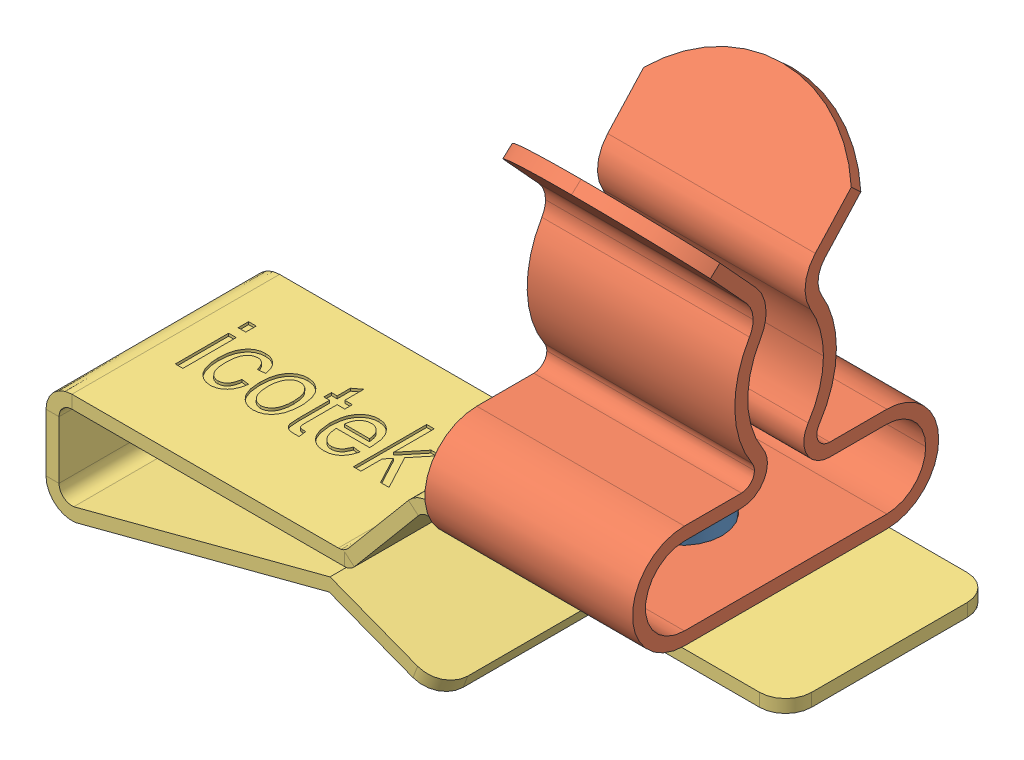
SolidWorks assembly 36786_2.SLDASM, configuration Default (file format 8000). Lengths in mm.
Overall size (28.5 21.09 11.8).
3 component instances, 3 part files, 0 mates.
Components (placement in the parent):
- 36786_2_01-1: 36786_2_01.SLDPRT [Default] at origin size (6 4.5 6)
- 36786_2_02-1: 36786_2_02.SLDPRT [Default] at origin size (8 13.57 11.8)
- 36786_2_03-1: 36786_2_03.SLDPRT [Default] at origin size (28.5 7.52 8)
